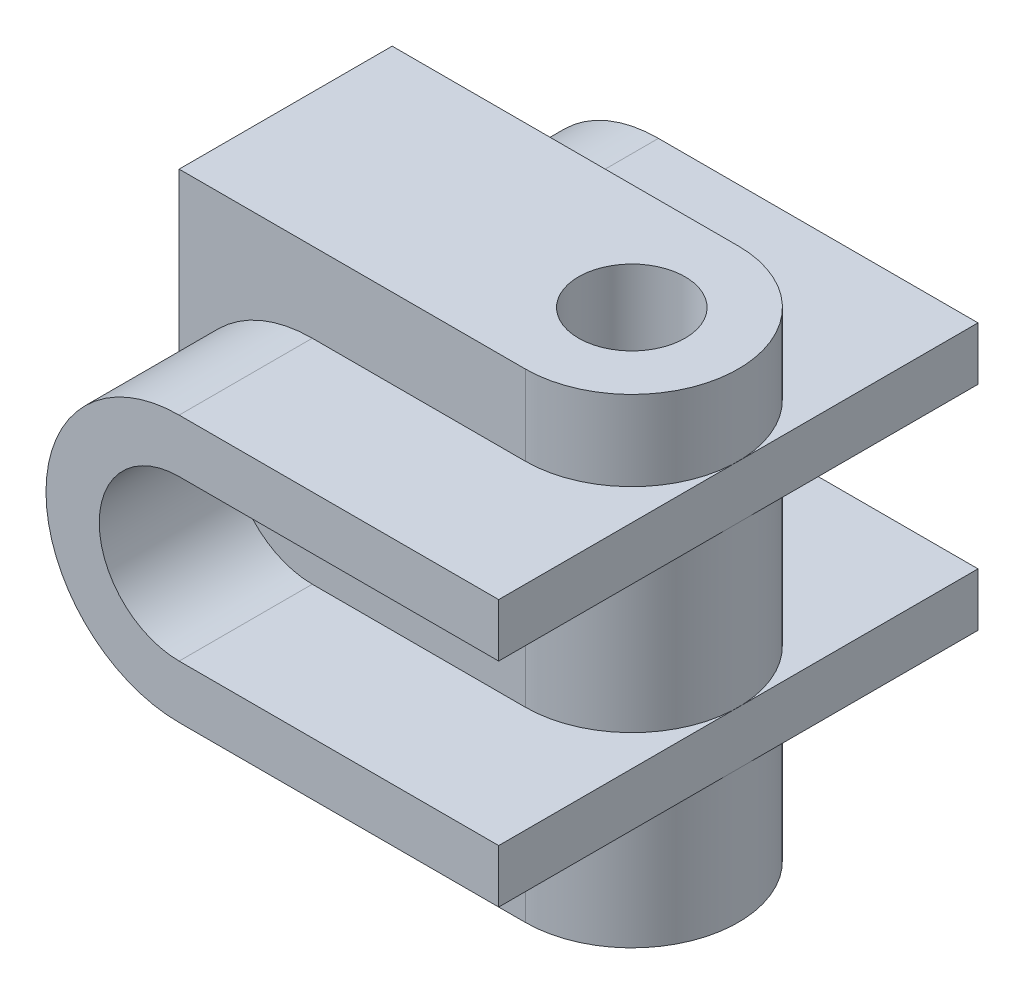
from build123d import *

# Parameters (mm, degrees)
EXTRUDE_THIN1_DEPTH = 90
SKETCH2_R           = 10
EXTRUDE1_DEPTH      = 90


with BuildPart() as part:
    # Sketch1 → Extrude-Thin1 (new body)
    with BuildSketch(Plane.XY):
        with BuildLine():
            Line((0, -15), (-60, -15))
            ThreePointArc((-60, -15), (-85, -40), (-60, -65))
            Line((-60, -65), (0, -65))
            Line((0, -65), (0, -55))
            Line((0, -55), (-60, -55))
            ThreePointArc((-60, -55), (-75, -40), (-60, -25))
            Line((-60, -25), (0, -25))
            Line((0, -25), (0, -15))
        make_face()
    extrude(amount=EXTRUDE_THIN1_DEPTH)


with BuildPart() as body_2:
    # Sketch2 → Extrude1 (new body)
    with BuildSketch(Plane(origin=(0, 0, 0), x_dir=(1, 0, 0), z_dir=(0, 1, 0))):
        with BuildLine():
            Line((-85, -25), (-85, -65))
            Line((-85, -65), (-20, -65))
            ThreePointArc((-20, -65), (0, -45), (-20, -25))
            Line((-20, -25), (-85, -25))
        make_face()
        with Locations(Location((-20, -45, 0), (0, 0, 270))):
            Circle(SKETCH2_R, mode=Mode.SUBTRACT)
    extrude(amount=-EXTRUDE1_DEPTH)


solid = Compound([part.part, body_2.part])
